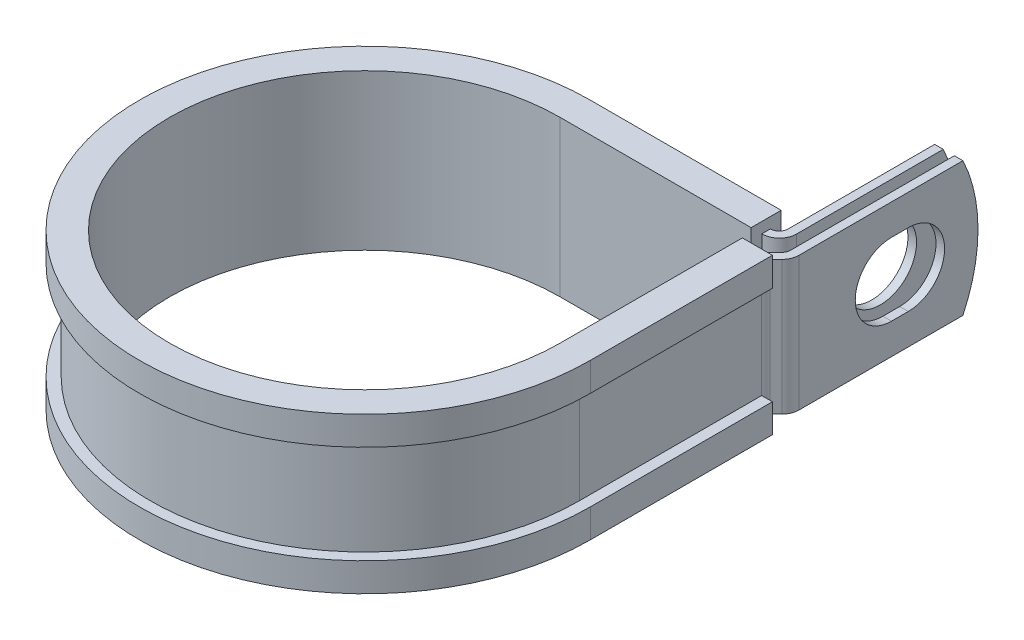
from build123d import *

# Parameters (mm, degrees)
EXTRUDE_THIN1_DEPTH = 9.525
SKETCH2_R           = 5.1562
CUT_EXTRUDE1_DEPTH  = 1.2192
CUT_EXTRUDE2_DEPTH  = 1.2192
CUT_EXTRUDE3_DEPTH  = 81.984483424


with BuildPart() as part:
    # Sketch1 → Extrude-Thin1 (new, symmetric)
    with BuildSketch(Plane(origin=(0, 0, 0), x_dir=(1, 0, 0), z_dir=(0, 1, 0))):
        with BuildLine():
            Line((31.1963698, 54.737), (31.1963698, 29.2989))
            ThreePointArc((31.1963698, 29.2989), (31.103563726, 28.832332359), (30.839274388, 28.436795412))
            Line((30.839274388, 28.436795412), (30.013090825, 27.610611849))
            ThreePointArc((30.013090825, 27.610611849), (29.484512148, 26.819537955), (29.2989, 25.886402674))
            Line((29.2989, 25.886402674), (29.2989, 0))
            ThreePointArc((29.2989, 0), (-20.717450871, -20.717450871), (0, 29.2989))
            Line((0, 29.2989), (27.1831698, 29.2989))
            ThreePointArc((27.1831698, 29.2989), (28.907378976, 30.013090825), (29.6215698, 31.7373))
            Line((29.6215698, 31.7373), (29.6215698, 54.737))
            Line((29.6215698, 54.737), (28.4023698, 54.737))
            Line((28.4023698, 54.737), (28.4023698, 31.7373))
            ThreePointArc((28.4023698, 31.7373), (28.045274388, 30.875195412), (27.1831698, 30.5181))
            Line((27.1831698, 30.5181), (0, 30.5181))
            ThreePointArc((0, 30.5181), (-21.579555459, -21.579555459), (30.5181, 0))
            Line((30.5181, 0), (30.5181, 25.886402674))
            ThreePointArc((30.5181, 25.886402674), (30.610906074, 26.352970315), (30.875195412, 26.748507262))
            Line((30.875195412, 26.748507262), (31.701378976, 27.574690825))
            ThreePointArc((31.701378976, 27.574690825), (32.229957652, 28.365764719), (32.4155698, 29.2989))
            Line((32.4155698, 29.2989), (32.4155698, 54.737))
            Line((32.4155698, 54.737), (31.1963698, 54.737))
        make_face()
    extrude(amount=EXTRUDE_THIN1_DEPTH, both=True)

    # Sketch2 → Cut-Extrude1 (cut)
    with BuildSketch(Plane.ZY.offset(-28.4023698)):
        with Locations((-43.6372, 0)):
            Circle(SKETCH2_R)
    extrude(amount=-CUT_EXTRUDE1_DEPTH, mode=Mode.SUBTRACT)

    # Sketch3 → Cut-Extrude2 (cut)
    with BuildSketch(Plane(origin=(32.4155698, 0, 0), x_dir=(0, 0, -1), z_dir=(1, 0, 0))):
        with BuildLine():
            Line((42.4434, 5.1562), (44.831, 5.1562))
            ThreePointArc((44.831, 5.1562), (49.9872, 0), (44.831, -5.1562))
            Line((44.831, -5.1562), (42.4434, -5.1562))
            ThreePointArc((42.4434, -5.1562), (37.2872, 0), (42.4434, 5.1562))
        make_face()
    extrude(amount=-CUT_EXTRUDE2_DEPTH, mode=Mode.SUBTRACT)

    # Sketch4 → Cut-Extrude3 (cut, through all)
    with BuildSketch(Plane.ZY.offset(-28.4023698)):
        with BuildLine():
            Line((-52.592463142, 9.525), (-54.737, 9.525))
            Line((-54.737, 9.525), (-54.737, -1.36e-07))
            ThreePointArc((-54.737, -1.36e-07), (-54.194238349, 4.881717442), (-52.592463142, 9.525))
        make_face()
        with BuildLine():
            ThreePointArc((-52.592463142, -9.525), (-54.194238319, -4.881717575), (-54.737, -1.36e-07))
            Line((-54.737, -1.36e-07), (-54.737, -9.525))
            Line((-54.737, -9.525), (-52.592463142, -9.525))
        make_face()
    extrude(amount=-CUT_EXTRUDE3_DEPTH, mode=Mode.SUBTRACT)

    # Sweep1: sweep along a path in Sketch6
    with BuildLine(Plane(origin=(0, 9.525, 0), x_dir=(1, 0, 0), z_dir=(0, 1, 0))) as sweep1_path:
        Line((27.7749, 25.886402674), (27.7749, 0))
        ThreePointArc((27.7749, 0), (-19.639820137, -19.639820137), (0, 27.7749))
        Line((0, 27.7749), (27.1323698, 27.7749))
    # Sketch5 → Sweep1 (sweep)
    with BuildSketch(Plane(origin=(0, 0, -25.886402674), x_dir=(-1, 0, 0), z_dir=(0, 0, -1))):
        Polygon((-30.5181, 9.525), (-29.2989, 9.525), (-29.2989, -9.525), (-30.5181, -9.525), (-30.5181, -6.985), (-32.0421, -6.985), (-32.0421, -11.049), (-27.7749, -11.049), (-27.7749, 11.049), (-32.0421, 11.049), (-32.0421, 6.985), (-30.5181, 6.985), align=None)
    sweep(path=sweep1_path.line)


solid = part.part
